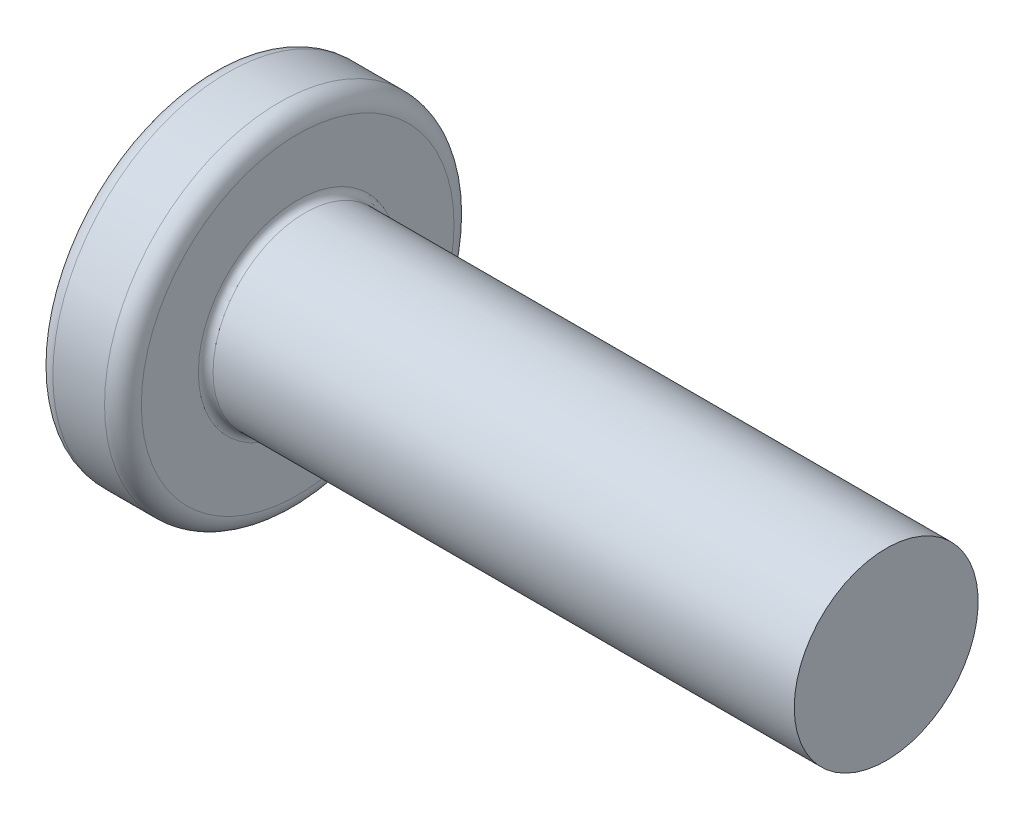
from build123d import *

# Parameters (mm, degrees)
FILLET1_R    = 0.2
RECPAT_COUNT = 2
RECPAT_ANGLE = 90
CONG_1_R     = 0.5


with BuildPart() as part:
    # BodySke → Base-Revolve (revolve)
    with BuildSketch(Plane.XY, mode=Mode.PRIVATE) as base_revolve_sk:
        with BuildLine():
            Line((3.7, 2.5), (3.7, 4.75))
            Line((3.7, 4.75), (1.79415598, 4.75))
            ThreePointArc((1.79415598, 4.75), (1.58538712, 4.698642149), (1.424271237, 4.556291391))
            ThreePointArc((1.424271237, 4.556291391), (0.364365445, 2.386856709), (0, 0))
            Line((0, 0), (19.7, 0))
            Line((19.7, 0), (19.7, 2.5))
            Line((19.7, 2.5), (3.7, 2.5))
        make_face()
    revolve(base_revolve_sk.sketch.rotate(Axis((1.79415598, 0, 0), (1, 0, 0)), 90), axis=Axis((1.79415598, 0, 0), (1, 0, 0)))

    # Fillet1
    fillet1_edges = [part.edges().sort_by_distance(p)[0] for p in [
        (3.7, 0, -2.5),
    ]]
    fillet(fillet1_edges, radius=FILLET1_R)

    # Sketch3 → Recess section 0
    with BuildSketch(Plane(origin=(0, 0, 0), x_dir=(0, 0, -1), z_dir=(1, 0, 0))):
        with BuildLine():
            Line((0.515, -2.35), (-0.515, -2.35))
            Line((-0.515, -2.35), (-0.515, 2.35))
            Line((-0.515, 2.35), (0.515, 2.35))
            Line((0.515, 2.35), (0.515, -2.35))
        make_face()
    # Sketch4 → Recess section 1
    with BuildSketch(Plane(origin=(2.74, 0, 0), x_dir=(0, 0, -1), z_dir=(1, 0, 0))):
        with BuildLine():
            Line((0.515, -0.983886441), (-0.515, -0.983886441))
            Line((-0.515, -0.983886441), (-0.515, 0.983886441))
            Line((-0.515, 0.983886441), (0.515, 0.983886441))
            Line((0.515, 0.983886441), (0.515, -0.983886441))
        make_face()
    recess = loft(mode=Mode.SUBTRACT)

    # RecPat: Recess ×2 about axis
    recpat_axis = Axis((0, 0, 0), (1, 0, 0))
    for i in range(1, RECPAT_COUNT):
        add(recess.rotate(recpat_axis, i * RECPAT_ANGLE / (RECPAT_COUNT - 1)), mode=Mode.SUBTRACT)

    # RecCorSke → RecessCore (revolve, cut)
    with BuildSketch(Plane.XY, mode=Mode.PRIVATE) as recesscore_sk:
        Polygon((0, 0), (0, 1.042599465), (2.74, 0.851), (3.016506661, 0), align=None)
    revolve(recesscore_sk.sketch.rotate(Axis((-3.175, 0, 0), (1, 0, 0)), 13.238159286), axis=Axis((-3.175, 0, 0), (1, 0, 0)), mode=Mode.SUBTRACT)

    # Cong_1
    cong_1_edges = [part.edges().sort_by_distance(p)[0] for p in [
        (3.7, 0, -4.75),
    ]]
    fillet(cong_1_edges, radius=CONG_1_R)


solid = part.part
